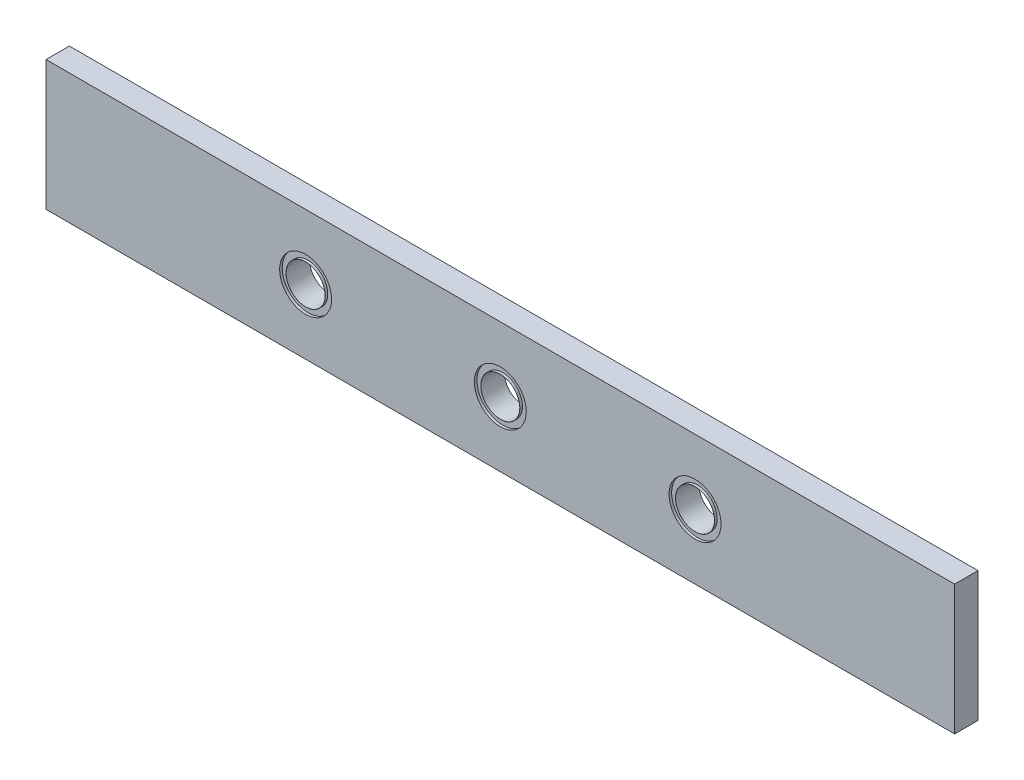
ISO-10303-21;
HEADER;
FILE_DESCRIPTION(('STEP AP214'),'2;1');
FILE_NAME('part.step','',(''),(''),'','','');
FILE_SCHEMA(('AUTOMOTIVE_DESIGN { 1 0 10303 214 1 1 1 1 }'));
ENDSEC;
DATA;
#1=APPLICATION_CONTEXT('core data for automotive mechanical design processes');
#2=APPLICATION_PROTOCOL_DEFINITION('international standard','automotive_design',2000,#1);
#3=PRODUCT_CONTEXT('',#1,'mechanical');
#4=PRODUCT('Part','Part','',(#3));
#5=PRODUCT_RELATED_PRODUCT_CATEGORY('part','',(#4));
#6=PRODUCT_DEFINITION_FORMATION('','',#4);
#7=PRODUCT_DEFINITION_CONTEXT('part definition',#1,'design');
#8=PRODUCT_DEFINITION('design','',#6,#7);
#9=PRODUCT_DEFINITION_SHAPE('','',#8);
#10=(LENGTH_UNIT() NAMED_UNIT(*) SI_UNIT(.MILLI.,.METRE.));
#11=(NAMED_UNIT(*) PLANE_ANGLE_UNIT() SI_UNIT($,.RADIAN.));
#12=(NAMED_UNIT(*) SI_UNIT($,.STERADIAN.) SOLID_ANGLE_UNIT());
#13=UNCERTAINTY_MEASURE_WITH_UNIT(LENGTH_MEASURE(1.E-05),#10,'distance_accuracy_value','');
#14=(GEOMETRIC_REPRESENTATION_CONTEXT(3) GLOBAL_UNCERTAINTY_ASSIGNED_CONTEXT((#13)) GLOBAL_UNIT_ASSIGNED_CONTEXT((#10,
#11,#12)) REPRESENTATION_CONTEXT('',''));
#15=CARTESIAN_POINT('',(0.,0.,0.));
#16=DIRECTION('',(0.,0.,1.));
#17=DIRECTION('',(1.,0.,0.));
#18=AXIS2_PLACEMENT_3D('',#15,#16,#17);
#19=CARTESIAN_POINT('',(0.,0.,0.));
#20=DIRECTION('',(0.,0.,1.));
#21=DIRECTION('',(1.,0.,0.));
#22=AXIS2_PLACEMENT_3D('',#19,#20,#21);
#23=PLANE('',#22);
#24=DIRECTION('',(0.,1.,0.));
#25=VECTOR('',#24,1.);
#26=CARTESIAN_POINT('',(350.,50.,0.));
#27=LINE('',#26,#25);
#28=CARTESIAN_POINT('',(350.,-50.,0.));
#29=VERTEX_POINT('',#28);
#30=CARTESIAN_POINT('',(350.,50.,0.));
#31=VERTEX_POINT('',#30);
#32=EDGE_CURVE('E96',#29,#31,#27,.T.);
#33=ORIENTED_EDGE('',*,*,#32,.F.);
#34=DIRECTION('',(1.,0.,0.));
#35=VECTOR('',#34,1.);
#36=CARTESIAN_POINT('',(-350.,-50.,0.));
#37=LINE('',#36,#35);
#38=CARTESIAN_POINT('',(-350.,-50.,0.));
#39=VERTEX_POINT('',#38);
#40=EDGE_CURVE('E72',#39,#29,#37,.T.);
#41=ORIENTED_EDGE('',*,*,#40,.F.);
#42=DIRECTION('',(0.,-1.,0.));
#43=VECTOR('',#42,1.);
#44=CARTESIAN_POINT('',(-350.,50.,0.));
#45=LINE('',#44,#43);
#46=CARTESIAN_POINT('',(-350.,50.,0.));
#47=VERTEX_POINT('',#46);
#48=EDGE_CURVE('E66',#47,#39,#45,.T.);
#49=ORIENTED_EDGE('',*,*,#48,.F.);
#50=DIRECTION('',(-1.,0.,0.));
#51=VECTOR('',#50,1.);
#52=CARTESIAN_POINT('',(-350.,50.,0.));
#53=LINE('',#52,#51);
#54=EDGE_CURVE('E88',#31,#47,#53,.T.);
#55=ORIENTED_EDGE('',*,*,#54,.F.);
#56=EDGE_LOOP('',(#33,#41,#49,#55));
#57=FACE_BOUND('',#56,.T.);
#58=CARTESIAN_POINT('',(0.,0.,0.));
#59=DIRECTION('',(0.,0.,1.));
#60=DIRECTION('',(1.,0.,0.));
#61=AXIS2_PLACEMENT_3D('',#58,#59,#60);
#62=CIRCLE('',#61,20.);
#63=CARTESIAN_POINT('',(20.,0.,0.));
#64=VERTEX_POINT('',#63);
#65=EDGE_CURVE('E164',#64,#64,#62,.T.);
#66=ORIENTED_EDGE('',*,*,#65,.T.);
#67=EDGE_LOOP('',(#66));
#68=FACE_BOUND('',#67,.T.);
#69=CARTESIAN_POINT('',(-150.,0.,0.));
#70=DIRECTION('',(0.,0.,1.));
#71=DIRECTION('',(1.,0.,0.));
#72=AXIS2_PLACEMENT_3D('',#69,#70,#71);
#73=CIRCLE('',#72,20.);
#74=CARTESIAN_POINT('',(-130.,0.,0.));
#75=VERTEX_POINT('',#74);
#76=EDGE_CURVE('E176',#75,#75,#73,.T.);
#77=ORIENTED_EDGE('',*,*,#76,.T.);
#78=EDGE_LOOP('',(#77));
#79=FACE_BOUND('',#78,.T.);
#80=CARTESIAN_POINT('',(150.,0.,0.));
#81=DIRECTION('',(0.,0.,1.));
#82=DIRECTION('',(1.,0.,0.));
#83=AXIS2_PLACEMENT_3D('',#80,#81,#82);
#84=CIRCLE('',#83,20.);
#85=CARTESIAN_POINT('',(170.,0.,0.));
#86=VERTEX_POINT('',#85);
#87=EDGE_CURVE('E188',#86,#86,#84,.T.);
#88=ORIENTED_EDGE('',*,*,#87,.T.);
#89=EDGE_LOOP('',(#88));
#90=FACE_BOUND('',#89,.T.);
#91=ADVANCED_FACE('F32',(#57,#68,#79,#90),#23,.F.);
#92=CARTESIAN_POINT('',(150.,0.,0.));
#93=DIRECTION('',(0.,0.,1.));
#94=DIRECTION('',(1.,0.,0.));
#95=AXIS2_PLACEMENT_3D('',#92,#93,#94);
#96=CIRCLE('',#95,15.05);
#97=CARTESIAN_POINT('',(165.05,0.,0.));
#98=VERTEX_POINT('',#97);
#99=EDGE_CURVE('E194',#98,#98,#96,.T.);
#100=ORIENTED_EDGE('',*,*,#99,.F.);
#101=EDGE_LOOP('',(#100));
#102=FACE_BOUND('',#101,.T.);
#103=CARTESIAN_POINT('',(150.,0.,0.));
#104=DIRECTION('',(0.,0.,1.));
#105=DIRECTION('',(1.,0.,0.));
#106=AXIS2_PLACEMENT_3D('',#103,#104,#105);
#107=CIRCLE('',#106,15.);
#108=CARTESIAN_POINT('',(165.,0.,0.));
#109=VERTEX_POINT('',#108);
#110=EDGE_CURVE('E99',#109,#109,#107,.T.);
#111=ORIENTED_EDGE('',*,*,#110,.T.);
#112=EDGE_LOOP('',(#111));
#113=FACE_BOUND('',#112,.T.);
#114=ADVANCED_FACE('F209',(#102,#113),#23,.F.);
#115=CARTESIAN_POINT('',(-150.,0.,0.));
#116=DIRECTION('',(0.,0.,1.));
#117=DIRECTION('',(1.,0.,0.));
#118=AXIS2_PLACEMENT_3D('',#115,#116,#117);
#119=CIRCLE('',#118,15.05);
#120=CARTESIAN_POINT('',(-134.95,0.,0.));
#121=VERTEX_POINT('',#120);
#122=EDGE_CURVE('E182',#121,#121,#119,.T.);
#123=ORIENTED_EDGE('',*,*,#122,.F.);
#124=EDGE_LOOP('',(#123));
#125=FACE_BOUND('',#124,.T.);
#126=CARTESIAN_POINT('',(-150.,0.,0.));
#127=DIRECTION('',(0.,0.,1.));
#128=DIRECTION('',(-1.,0.,0.));
#129=AXIS2_PLACEMENT_3D('',#126,#127,#128);
#130=CIRCLE('',#129,15.);
#131=CARTESIAN_POINT('',(-165.,0.,0.));
#132=VERTEX_POINT('',#131);
#133=EDGE_CURVE('E113',#132,#132,#130,.T.);
#134=ORIENTED_EDGE('',*,*,#133,.T.);
#135=EDGE_LOOP('',(#134));
#136=FACE_BOUND('',#135,.T.);
#137=ADVANCED_FACE('F212',(#125,#136),#23,.F.);
#138=CARTESIAN_POINT('',(0.,0.,18.));
#139=DIRECTION('',(0.,0.,1.));
#140=DIRECTION('',(1.,0.,0.));
#141=AXIS2_PLACEMENT_3D('',#138,#139,#140);
#142=PLANE('',#141);
#143=CARTESIAN_POINT('',(150.,0.,18.));
#144=DIRECTION('',(0.,0.,1.));
#145=DIRECTION('',(1.,0.,0.));
#146=AXIS2_PLACEMENT_3D('',#143,#144,#145);
#147=CIRCLE('',#146,15.);
#148=CARTESIAN_POINT('',(165.,0.,18.));
#149=VERTEX_POINT('',#148);
#150=EDGE_CURVE('E110',#149,#149,#147,.T.);
#151=ORIENTED_EDGE('',*,*,#150,.F.);
#152=EDGE_LOOP('',(#151));
#153=FACE_BOUND('',#152,.T.);
#154=CARTESIAN_POINT('',(150.,0.,18.));
#155=DIRECTION('',(0.,0.,1.));
#156=DIRECTION('',(1.,0.,0.));
#157=AXIS2_PLACEMENT_3D('',#154,#155,#156);
#158=CIRCLE('',#157,15.05);
#159=CARTESIAN_POINT('',(165.05,0.,18.));
#160=VERTEX_POINT('',#159);
#161=EDGE_CURVE('E158',#160,#160,#158,.T.);
#162=ORIENTED_EDGE('',*,*,#161,.T.);
#163=EDGE_LOOP('',(#162));
#164=FACE_BOUND('',#163,.T.);
#165=ADVANCED_FACE('F224',(#153,#164),#142,.T.);
#166=CARTESIAN_POINT('',(-150.,0.,18.));
#167=DIRECTION('',(0.,0.,1.));
#168=DIRECTION('',(-1.,0.,0.));
#169=AXIS2_PLACEMENT_3D('',#166,#167,#168);
#170=CIRCLE('',#169,15.);
#171=CARTESIAN_POINT('',(-165.,0.,18.));
#172=VERTEX_POINT('',#171);
#173=EDGE_CURVE('E116',#172,#172,#170,.T.);
#174=ORIENTED_EDGE('',*,*,#173,.F.);
#175=EDGE_LOOP('',(#174));
#176=FACE_BOUND('',#175,.T.);
#177=CARTESIAN_POINT('',(-150.,0.,18.));
#178=DIRECTION('',(0.,0.,1.));
#179=DIRECTION('',(1.,0.,0.));
#180=AXIS2_PLACEMENT_3D('',#177,#178,#179);
#181=CIRCLE('',#180,15.05);
#182=CARTESIAN_POINT('',(-134.95,0.,18.));
#183=VERTEX_POINT('',#182);
#184=EDGE_CURVE('E146',#183,#183,#181,.T.);
#185=ORIENTED_EDGE('',*,*,#184,.T.);
#186=EDGE_LOOP('',(#185));
#187=FACE_BOUND('',#186,.T.);
#188=ADVANCED_FACE('F227',(#176,#187),#142,.T.);
#189=CARTESIAN_POINT('',(0.,0.,18.));
#190=DIRECTION('',(0.,0.,1.));
#191=DIRECTION('',(1.,0.,0.));
#192=AXIS2_PLACEMENT_3D('',#189,#190,#191);
#193=CIRCLE('',#192,15.);
#194=CARTESIAN_POINT('',(15.,0.,18.));
#195=VERTEX_POINT('',#194);
#196=EDGE_CURVE('E122',#195,#195,#193,.T.);
#197=ORIENTED_EDGE('',*,*,#196,.F.);
#198=EDGE_LOOP('',(#197));
#199=FACE_BOUND('',#198,.T.);
#200=CARTESIAN_POINT('',(0.,0.,18.));
#201=DIRECTION('',(0.,0.,1.));
#202=DIRECTION('',(1.,0.,0.));
#203=AXIS2_PLACEMENT_3D('',#200,#201,#202);
#204=CIRCLE('',#203,15.05);
#205=CARTESIAN_POINT('',(15.05,0.,18.));
#206=VERTEX_POINT('',#205);
#207=EDGE_CURVE('E134',#206,#206,#204,.T.);
#208=ORIENTED_EDGE('',*,*,#207,.T.);
#209=EDGE_LOOP('',(#208));
#210=FACE_BOUND('',#209,.T.);
#211=ADVANCED_FACE('F258',(#199,#210),#142,.T.);
#212=CARTESIAN_POINT('',(350.,50.,18.));
#213=DIRECTION('',(-1.,0.,0.));
#214=DIRECTION('',(0.,-1.,0.));
#215=AXIS2_PLACEMENT_3D('',#212,#213,#214);
#216=PLANE('',#215);
#217=ORIENTED_EDGE('',*,*,#32,.T.);
#218=DIRECTION('',(0.,0.,-1.));
#219=VECTOR('',#218,1.);
#220=CARTESIAN_POINT('',(350.,50.,18.));
#221=LINE('',#220,#219);
#222=CARTESIAN_POINT('',(350.,50.,18.));
#223=VERTEX_POINT('',#222);
#224=EDGE_CURVE('E11',#223,#31,#221,.T.);
#225=ORIENTED_EDGE('',*,*,#224,.F.);
#226=DIRECTION('',(0.,1.,0.));
#227=VECTOR('',#226,1.);
#228=CARTESIAN_POINT('',(350.,50.,18.));
#229=LINE('',#228,#227);
#230=CARTESIAN_POINT('',(350.,-50.,18.));
#231=VERTEX_POINT('',#230);
#232=EDGE_CURVE('E84',#231,#223,#229,.T.);
#233=ORIENTED_EDGE('',*,*,#232,.F.);
#234=DIRECTION('',(0.,0.,-1.));
#235=VECTOR('',#234,1.);
#236=CARTESIAN_POINT('',(350.,-50.,18.));
#237=LINE('',#236,#235);
#238=EDGE_CURVE('E92',#231,#29,#237,.T.);
#239=ORIENTED_EDGE('',*,*,#238,.T.);
#240=EDGE_LOOP('',(#217,#225,#233,#239));
#241=FACE_BOUND('',#240,.T.);
#242=ADVANCED_FACE('F34',(#241),#216,.F.);
#243=CARTESIAN_POINT('',(-350.,50.,18.));
#244=DIRECTION('',(0.,-1.,0.));
#245=DIRECTION('',(0.,0.,-1.));
#246=AXIS2_PLACEMENT_3D('',#243,#244,#245);
#247=PLANE('',#246);
#248=ORIENTED_EDGE('',*,*,#54,.T.);
#249=DIRECTION('',(0.,0.,-1.));
#250=VECTOR('',#249,1.);
#251=CARTESIAN_POINT('',(-350.,50.,18.));
#252=LINE('',#251,#250);
#253=CARTESIAN_POINT('',(-350.,50.,18.));
#254=VERTEX_POINT('',#253);
#255=EDGE_CURVE('E41',#254,#47,#252,.T.);
#256=ORIENTED_EDGE('',*,*,#255,.F.);
#257=DIRECTION('',(-1.,0.,0.));
#258=VECTOR('',#257,1.);
#259=CARTESIAN_POINT('',(-350.,50.,18.));
#260=LINE('',#259,#258);
#261=EDGE_CURVE('E79',#223,#254,#260,.T.);
#262=ORIENTED_EDGE('',*,*,#261,.F.);
#263=ORIENTED_EDGE('',*,*,#224,.T.);
#264=EDGE_LOOP('',(#248,#256,#262,#263));
#265=FACE_BOUND('',#264,.T.);
#266=ADVANCED_FACE('F87',(#265),#247,.F.);
#267=CARTESIAN_POINT('',(-350.,50.,18.));
#268=DIRECTION('',(1.,0.,0.));
#269=DIRECTION('',(0.,1.,0.));
#270=AXIS2_PLACEMENT_3D('',#267,#268,#269);
#271=PLANE('',#270);
#272=ORIENTED_EDGE('',*,*,#48,.T.);
#273=DIRECTION('',(0.,0.,-1.));
#274=VECTOR('',#273,1.);
#275=CARTESIAN_POINT('',(-350.,-50.,18.));
#276=LINE('',#275,#274);
#277=CARTESIAN_POINT('',(-350.,-50.,18.));
#278=VERTEX_POINT('',#277);
#279=EDGE_CURVE('E89',#278,#39,#276,.T.);
#280=ORIENTED_EDGE('',*,*,#279,.F.);
#281=DIRECTION('',(0.,-1.,0.));
#282=VECTOR('',#281,1.);
#283=CARTESIAN_POINT('',(-350.,50.,18.));
#284=LINE('',#283,#282);
#285=EDGE_CURVE('E82',#254,#278,#284,.T.);
#286=ORIENTED_EDGE('',*,*,#285,.F.);
#287=ORIENTED_EDGE('',*,*,#255,.T.);
#288=EDGE_LOOP('',(#272,#280,#286,#287));
#289=FACE_BOUND('',#288,.T.);
#290=ADVANCED_FACE('F90',(#289),#271,.F.);
#291=CARTESIAN_POINT('',(-350.,-50.,18.));
#292=DIRECTION('',(0.,1.,0.));
#293=DIRECTION('',(0.,0.,1.));
#294=AXIS2_PLACEMENT_3D('',#291,#292,#293);
#295=PLANE('',#294);
#296=ORIENTED_EDGE('',*,*,#40,.T.);
#297=ORIENTED_EDGE('',*,*,#238,.F.);
#298=DIRECTION('',(1.,0.,0.));
#299=VECTOR('',#298,1.);
#300=CARTESIAN_POINT('',(-350.,-50.,18.));
#301=LINE('',#300,#299);
#302=EDGE_CURVE('E49',#278,#231,#301,.T.);
#303=ORIENTED_EDGE('',*,*,#302,.F.);
#304=ORIENTED_EDGE('',*,*,#279,.T.);
#305=EDGE_LOOP('',(#296,#297,#303,#304));
#306=FACE_BOUND('',#305,.T.);
#307=ADVANCED_FACE('F104',(#306),#295,.F.);
#308=CARTESIAN_POINT('',(150.,0.,18.));
#309=DIRECTION('',(0.,0.,1.));
#310=DIRECTION('',(1.,0.,0.));
#311=AXIS2_PLACEMENT_3D('',#308,#309,#310);
#312=CIRCLE('',#311,20.);
#313=CARTESIAN_POINT('',(170.,0.,18.));
#314=VERTEX_POINT('',#313);
#315=EDGE_CURVE('E152',#314,#314,#312,.T.);
#316=ORIENTED_EDGE('',*,*,#315,.F.);
#317=EDGE_LOOP('',(#316));
#318=FACE_BOUND('',#317,.T.);
#319=CARTESIAN_POINT('',(-150.,0.,18.));
#320=DIRECTION('',(0.,0.,1.));
#321=DIRECTION('',(1.,0.,0.));
#322=AXIS2_PLACEMENT_3D('',#319,#320,#321);
#323=CIRCLE('',#322,20.);
#324=CARTESIAN_POINT('',(-130.,0.,18.));
#325=VERTEX_POINT('',#324);
#326=EDGE_CURVE('E140',#325,#325,#323,.T.);
#327=ORIENTED_EDGE('',*,*,#326,.F.);
#328=EDGE_LOOP('',(#327));
#329=FACE_BOUND('',#328,.T.);
#330=CARTESIAN_POINT('',(0.,0.,18.));
#331=DIRECTION('',(0.,0.,1.));
#332=DIRECTION('',(1.,0.,0.));
#333=AXIS2_PLACEMENT_3D('',#330,#331,#332);
#334=CIRCLE('',#333,20.);
#335=CARTESIAN_POINT('',(20.,0.,18.));
#336=VERTEX_POINT('',#335);
#337=EDGE_CURVE('E128',#336,#336,#334,.T.);
#338=ORIENTED_EDGE('',*,*,#337,.F.);
#339=EDGE_LOOP('',(#338));
#340=FACE_BOUND('',#339,.T.);
#341=ORIENTED_EDGE('',*,*,#232,.T.);
#342=ORIENTED_EDGE('',*,*,#261,.T.);
#343=ORIENTED_EDGE('',*,*,#285,.T.);
#344=ORIENTED_EDGE('',*,*,#302,.T.);
#345=EDGE_LOOP('',(#341,#342,#343,#344));
#346=FACE_BOUND('',#345,.T.);
#347=ADVANCED_FACE('F80',(#318,#329,#340,#346),#142,.T.);
#348=CARTESIAN_POINT('',(0.,0.,0.));
#349=DIRECTION('',(0.,0.,1.));
#350=DIRECTION('',(1.,0.,0.));
#351=AXIS2_PLACEMENT_3D('',#348,#349,#350);
#352=CIRCLE('',#351,15.05);
#353=CARTESIAN_POINT('',(15.05,0.,0.));
#354=VERTEX_POINT('',#353);
#355=EDGE_CURVE('E170',#354,#354,#352,.T.);
#356=ORIENTED_EDGE('',*,*,#355,.F.);
#357=EDGE_LOOP('',(#356));
#358=FACE_BOUND('',#357,.T.);
#359=CARTESIAN_POINT('',(0.,0.,0.));
#360=DIRECTION('',(0.,0.,1.));
#361=DIRECTION('',(1.,0.,0.));
#362=AXIS2_PLACEMENT_3D('',#359,#360,#361);
#363=CIRCLE('',#362,15.);
#364=CARTESIAN_POINT('',(15.,0.,0.));
#365=VERTEX_POINT('',#364);
#366=EDGE_CURVE('E119',#365,#365,#363,.T.);
#367=ORIENTED_EDGE('',*,*,#366,.T.);
#368=EDGE_LOOP('',(#367));
#369=FACE_BOUND('',#368,.T.);
#370=ADVANCED_FACE('F220',(#358,#369),#23,.F.);
#371=CARTESIAN_POINT('',(150.,0.,0.));
#372=DIRECTION('',(0.,0.,1.));
#373=DIRECTION('',(1.,0.,0.));
#374=AXIS2_PLACEMENT_3D('',#371,#372,#373);
#375=CYLINDRICAL_SURFACE('',#374,15.);
#376=ORIENTED_EDGE('',*,*,#110,.F.);
#377=EDGE_LOOP('',(#376));
#378=FACE_BOUND('',#377,.T.);
#379=ORIENTED_EDGE('',*,*,#150,.T.);
#380=EDGE_LOOP('',(#379));
#381=FACE_BOUND('',#380,.T.);
#382=ADVANCED_FACE('F216',(#378,#381),#375,.F.);
#383=CARTESIAN_POINT('',(-150.,0.,0.));
#384=DIRECTION('',(0.,0.,1.));
#385=DIRECTION('',(1.,0.,0.));
#386=AXIS2_PLACEMENT_3D('',#383,#384,#385);
#387=CYLINDRICAL_SURFACE('',#386,15.);
#388=ORIENTED_EDGE('',*,*,#133,.F.);
#389=EDGE_LOOP('',(#388));
#390=FACE_BOUND('',#389,.T.);
#391=ORIENTED_EDGE('',*,*,#173,.T.);
#392=EDGE_LOOP('',(#391));
#393=FACE_BOUND('',#392,.T.);
#394=ADVANCED_FACE('F219',(#390,#393),#387,.F.);
#395=CARTESIAN_POINT('',(0.,0.,0.));
#396=DIRECTION('',(0.,0.,1.));
#397=DIRECTION('',(1.,0.,0.));
#398=AXIS2_PLACEMENT_3D('',#395,#396,#397);
#399=CYLINDRICAL_SURFACE('',#398,15.);
#400=ORIENTED_EDGE('',*,*,#366,.F.);
#401=EDGE_LOOP('',(#400));
#402=FACE_BOUND('',#401,.T.);
#403=ORIENTED_EDGE('',*,*,#196,.T.);
#404=EDGE_LOOP('',(#403));
#405=FACE_BOUND('',#404,.T.);
#406=ADVANCED_FACE('F271',(#402,#405),#399,.F.);
#407=CARTESIAN_POINT('',(0.,0.,16.));
#408=DIRECTION('',(0.,0.,1.));
#409=DIRECTION('',(1.,0.,0.));
#410=AXIS2_PLACEMENT_3D('',#407,#408,#409);
#411=CYLINDRICAL_SURFACE('',#410,20.);
#412=CARTESIAN_POINT('',(0.,0.,16.));
#413=DIRECTION('',(0.,0.,1.));
#414=DIRECTION('',(1.,0.,0.));
#415=AXIS2_PLACEMENT_3D('',#412,#413,#414);
#416=CIRCLE('',#415,20.);
#417=CARTESIAN_POINT('',(20.,0.,16.));
#418=VERTEX_POINT('',#417);
#419=EDGE_CURVE('E125',#418,#418,#416,.T.);
#420=ORIENTED_EDGE('',*,*,#419,.F.);
#421=EDGE_LOOP('',(#420));
#422=FACE_BOUND('',#421,.T.);
#423=ORIENTED_EDGE('',*,*,#337,.T.);
#424=EDGE_LOOP('',(#423));
#425=FACE_BOUND('',#424,.T.);
#426=ADVANCED_FACE('F304',(#422,#425),#411,.F.);
#427=CARTESIAN_POINT('',(0.,0.,16.));
#428=DIRECTION('',(0.,0.,1.));
#429=DIRECTION('',(1.,0.,0.));
#430=AXIS2_PLACEMENT_3D('',#427,#428,#429);
#431=PLANE('',#430);
#432=CARTESIAN_POINT('',(0.,0.,16.));
#433=DIRECTION('',(0.,0.,1.));
#434=DIRECTION('',(1.,0.,0.));
#435=AXIS2_PLACEMENT_3D('',#432,#433,#434);
#436=CIRCLE('',#435,15.05);
#437=CARTESIAN_POINT('',(15.05,0.,16.));
#438=VERTEX_POINT('',#437);
#439=EDGE_CURVE('E131',#438,#438,#436,.T.);
#440=ORIENTED_EDGE('',*,*,#439,.F.);
#441=EDGE_LOOP('',(#440));
#442=FACE_BOUND('',#441,.T.);
#443=ORIENTED_EDGE('',*,*,#419,.T.);
#444=EDGE_LOOP('',(#443));
#445=FACE_BOUND('',#444,.T.);
#446=ADVANCED_FACE('F300',(#442,#445),#431,.T.);
#447=CARTESIAN_POINT('',(0.,0.,16.));
#448=DIRECTION('',(0.,0.,1.));
#449=DIRECTION('',(1.,0.,0.));
#450=AXIS2_PLACEMENT_3D('',#447,#448,#449);
#451=CYLINDRICAL_SURFACE('',#450,15.05);
#452=ORIENTED_EDGE('',*,*,#439,.T.);
#453=EDGE_LOOP('',(#452));
#454=FACE_BOUND('',#453,.T.);
#455=ORIENTED_EDGE('',*,*,#207,.F.);
#456=EDGE_LOOP('',(#455));
#457=FACE_BOUND('',#456,.T.);
#458=ADVANCED_FACE('F296',(#454,#457),#451,.T.);
#459=CARTESIAN_POINT('',(-150.,0.,16.));
#460=DIRECTION('',(0.,0.,1.));
#461=DIRECTION('',(1.,0.,0.));
#462=AXIS2_PLACEMENT_3D('',#459,#460,#461);
#463=CYLINDRICAL_SURFACE('',#462,20.);
#464=CARTESIAN_POINT('',(-150.,0.,16.));
#465=DIRECTION('',(0.,0.,1.));
#466=DIRECTION('',(1.,0.,0.));
#467=AXIS2_PLACEMENT_3D('',#464,#465,#466);
#468=CIRCLE('',#467,20.);
#469=CARTESIAN_POINT('',(-130.,0.,16.));
#470=VERTEX_POINT('',#469);
#471=EDGE_CURVE('E137',#470,#470,#468,.T.);
#472=ORIENTED_EDGE('',*,*,#471,.F.);
#473=EDGE_LOOP('',(#472));
#474=FACE_BOUND('',#473,.T.);
#475=ORIENTED_EDGE('',*,*,#326,.T.);
#476=EDGE_LOOP('',(#475));
#477=FACE_BOUND('',#476,.T.);
#478=ADVANCED_FACE('F290',(#474,#477),#463,.F.);
#479=CARTESIAN_POINT('',(-150.,0.,16.));
#480=DIRECTION('',(0.,0.,1.));
#481=DIRECTION('',(1.,0.,0.));
#482=AXIS2_PLACEMENT_3D('',#479,#480,#481);
#483=PLANE('',#482);
#484=CARTESIAN_POINT('',(-150.,0.,16.));
#485=DIRECTION('',(0.,0.,1.));
#486=DIRECTION('',(1.,0.,0.));
#487=AXIS2_PLACEMENT_3D('',#484,#485,#486);
#488=CIRCLE('',#487,15.05);
#489=CARTESIAN_POINT('',(-134.95,0.,16.));
#490=VERTEX_POINT('',#489);
#491=EDGE_CURVE('E143',#490,#490,#488,.T.);
#492=ORIENTED_EDGE('',*,*,#491,.F.);
#493=EDGE_LOOP('',(#492));
#494=FACE_BOUND('',#493,.T.);
#495=ORIENTED_EDGE('',*,*,#471,.T.);
#496=EDGE_LOOP('',(#495));
#497=FACE_BOUND('',#496,.T.);
#498=ADVANCED_FACE('F281',(#494,#497),#483,.T.);
#499=CARTESIAN_POINT('',(-150.,0.,16.));
#500=DIRECTION('',(0.,0.,1.));
#501=DIRECTION('',(1.,0.,0.));
#502=AXIS2_PLACEMENT_3D('',#499,#500,#501);
#503=CYLINDRICAL_SURFACE('',#502,15.05);
#504=ORIENTED_EDGE('',*,*,#491,.T.);
#505=EDGE_LOOP('',(#504));
#506=FACE_BOUND('',#505,.T.);
#507=ORIENTED_EDGE('',*,*,#184,.F.);
#508=EDGE_LOOP('',(#507));
#509=FACE_BOUND('',#508,.T.);
#510=ADVANCED_FACE('F279',(#506,#509),#503,.T.);
#511=CARTESIAN_POINT('',(150.,0.,16.));
#512=DIRECTION('',(0.,0.,1.));
#513=DIRECTION('',(1.,0.,0.));
#514=AXIS2_PLACEMENT_3D('',#511,#512,#513);
#515=CYLINDRICAL_SURFACE('',#514,20.);
#516=CARTESIAN_POINT('',(150.,0.,16.));
#517=DIRECTION('',(0.,0.,1.));
#518=DIRECTION('',(1.,0.,0.));
#519=AXIS2_PLACEMENT_3D('',#516,#517,#518);
#520=CIRCLE('',#519,20.);
#521=CARTESIAN_POINT('',(170.,0.,16.));
#522=VERTEX_POINT('',#521);
#523=EDGE_CURVE('E149',#522,#522,#520,.T.);
#524=ORIENTED_EDGE('',*,*,#523,.F.);
#525=EDGE_LOOP('',(#524));
#526=FACE_BOUND('',#525,.T.);
#527=ORIENTED_EDGE('',*,*,#315,.T.);
#528=EDGE_LOOP('',(#527));
#529=FACE_BOUND('',#528,.T.);
#530=ADVANCED_FACE('F244',(#526,#529),#515,.F.);
#531=CARTESIAN_POINT('',(150.,0.,16.));
#532=DIRECTION('',(0.,0.,1.));
#533=DIRECTION('',(1.,0.,0.));
#534=AXIS2_PLACEMENT_3D('',#531,#532,#533);
#535=PLANE('',#534);
#536=CARTESIAN_POINT('',(150.,0.,16.));
#537=DIRECTION('',(0.,0.,1.));
#538=DIRECTION('',(1.,0.,0.));
#539=AXIS2_PLACEMENT_3D('',#536,#537,#538);
#540=CIRCLE('',#539,15.05);
#541=CARTESIAN_POINT('',(165.05,0.,16.));
#542=VERTEX_POINT('',#541);
#543=EDGE_CURVE('E155',#542,#542,#540,.T.);
#544=ORIENTED_EDGE('',*,*,#543,.F.);
#545=EDGE_LOOP('',(#544));
#546=FACE_BOUND('',#545,.T.);
#547=ORIENTED_EDGE('',*,*,#523,.T.);
#548=EDGE_LOOP('',(#547));
#549=FACE_BOUND('',#548,.T.);
#550=ADVANCED_FACE('F234',(#546,#549),#535,.T.);
#551=CARTESIAN_POINT('',(150.,0.,16.));
#552=DIRECTION('',(0.,0.,1.));
#553=DIRECTION('',(1.,0.,0.));
#554=AXIS2_PLACEMENT_3D('',#551,#552,#553);
#555=CYLINDRICAL_SURFACE('',#554,15.05);
#556=ORIENTED_EDGE('',*,*,#543,.T.);
#557=EDGE_LOOP('',(#556));
#558=FACE_BOUND('',#557,.T.);
#559=ORIENTED_EDGE('',*,*,#161,.F.);
#560=EDGE_LOOP('',(#559));
#561=FACE_BOUND('',#560,.T.);
#562=ADVANCED_FACE('F231',(#558,#561),#555,.T.);
#563=CARTESIAN_POINT('',(0.,0.,2.));
#564=DIRECTION('',(0.,0.,-1.));
#565=DIRECTION('',(1.,0.,0.));
#566=AXIS2_PLACEMENT_3D('',#563,#564,#565);
#567=PLANE('',#566);
#568=CARTESIAN_POINT('',(0.,0.,2.));
#569=DIRECTION('',(0.,0.,1.));
#570=DIRECTION('',(1.,0.,0.));
#571=AXIS2_PLACEMENT_3D('',#568,#569,#570);
#572=CIRCLE('',#571,20.);
#573=CARTESIAN_POINT('',(20.,0.,2.));
#574=VERTEX_POINT('',#573);
#575=EDGE_CURVE('E161',#574,#574,#572,.T.);
#576=ORIENTED_EDGE('',*,*,#575,.F.);
#577=EDGE_LOOP('',(#576));
#578=FACE_BOUND('',#577,.T.);
#579=CARTESIAN_POINT('',(0.,0.,2.));
#580=DIRECTION('',(0.,0.,1.));
#581=DIRECTION('',(1.,0.,0.));
#582=AXIS2_PLACEMENT_3D('',#579,#580,#581);
#583=CIRCLE('',#582,15.05);
#584=CARTESIAN_POINT('',(15.05,0.,2.));
#585=VERTEX_POINT('',#584);
#586=EDGE_CURVE('E167',#585,#585,#583,.T.);
#587=ORIENTED_EDGE('',*,*,#586,.T.);
#588=EDGE_LOOP('',(#587));
#589=FACE_BOUND('',#588,.T.);
#590=ADVANCED_FACE('F233',(#578,#589),#567,.T.);
#591=CARTESIAN_POINT('',(0.,0.,2.));
#592=DIRECTION('',(0.,0.,-1.));
#593=DIRECTION('',(-1.,0.,0.));
#594=AXIS2_PLACEMENT_3D('',#591,#592,#593);
#595=CYLINDRICAL_SURFACE('',#594,20.);
#596=ORIENTED_EDGE('',*,*,#575,.T.);
#597=EDGE_LOOP('',(#596));
#598=FACE_BOUND('',#597,.T.);
#599=ORIENTED_EDGE('',*,*,#65,.F.);
#600=EDGE_LOOP('',(#599));
#601=FACE_BOUND('',#600,.T.);
#602=ADVANCED_FACE('F241',(#598,#601),#595,.F.);
#603=CARTESIAN_POINT('',(0.,0.,2.));
#604=DIRECTION('',(0.,0.,-1.));
#605=DIRECTION('',(-1.,0.,0.));
#606=AXIS2_PLACEMENT_3D('',#603,#604,#605);
#607=CYLINDRICAL_SURFACE('',#606,15.05);
#608=ORIENTED_EDGE('',*,*,#586,.F.);
#609=EDGE_LOOP('',(#608));
#610=FACE_BOUND('',#609,.T.);
#611=ORIENTED_EDGE('',*,*,#355,.T.);
#612=EDGE_LOOP('',(#611));
#613=FACE_BOUND('',#612,.T.);
#614=ADVANCED_FACE('F429',(#610,#613),#607,.T.);
#615=CARTESIAN_POINT('',(-150.,0.,2.));
#616=DIRECTION('',(0.,0.,-1.));
#617=DIRECTION('',(1.,0.,0.));
#618=AXIS2_PLACEMENT_3D('',#615,#616,#617);
#619=PLANE('',#618);
#620=CARTESIAN_POINT('',(-150.,0.,2.));
#621=DIRECTION('',(0.,0.,1.));
#622=DIRECTION('',(1.,0.,0.));
#623=AXIS2_PLACEMENT_3D('',#620,#621,#622);
#624=CIRCLE('',#623,20.);
#625=CARTESIAN_POINT('',(-130.,0.,2.));
#626=VERTEX_POINT('',#625);
#627=EDGE_CURVE('E173',#626,#626,#624,.T.);
#628=ORIENTED_EDGE('',*,*,#627,.F.);
#629=EDGE_LOOP('',(#628));
#630=FACE_BOUND('',#629,.T.);
#631=CARTESIAN_POINT('',(-150.,0.,2.));
#632=DIRECTION('',(0.,0.,1.));
#633=DIRECTION('',(1.,0.,0.));
#634=AXIS2_PLACEMENT_3D('',#631,#632,#633);
#635=CIRCLE('',#634,15.05);
#636=CARTESIAN_POINT('',(-134.95,0.,2.));
#637=VERTEX_POINT('',#636);
#638=EDGE_CURVE('E179',#637,#637,#635,.T.);
#639=ORIENTED_EDGE('',*,*,#638,.T.);
#640=EDGE_LOOP('',(#639));
#641=FACE_BOUND('',#640,.T.);
#642=ADVANCED_FACE('F438',(#630,#641),#619,.T.);
#643=CARTESIAN_POINT('',(-150.,0.,2.));
#644=DIRECTION('',(0.,0.,-1.));
#645=DIRECTION('',(-1.,0.,0.));
#646=AXIS2_PLACEMENT_3D('',#643,#644,#645);
#647=CYLINDRICAL_SURFACE('',#646,20.);
#648=ORIENTED_EDGE('',*,*,#627,.T.);
#649=EDGE_LOOP('',(#648));
#650=FACE_BOUND('',#649,.T.);
#651=ORIENTED_EDGE('',*,*,#76,.F.);
#652=EDGE_LOOP('',(#651));
#653=FACE_BOUND('',#652,.T.);
#654=ADVANCED_FACE('F448',(#650,#653),#647,.F.);
#655=CARTESIAN_POINT('',(-150.,0.,2.));
#656=DIRECTION('',(0.,0.,-1.));
#657=DIRECTION('',(-1.,0.,0.));
#658=AXIS2_PLACEMENT_3D('',#655,#656,#657);
#659=CYLINDRICAL_SURFACE('',#658,15.05);
#660=ORIENTED_EDGE('',*,*,#638,.F.);
#661=EDGE_LOOP('',(#660));
#662=FACE_BOUND('',#661,.T.);
#663=ORIENTED_EDGE('',*,*,#122,.T.);
#664=EDGE_LOOP('',(#663));
#665=FACE_BOUND('',#664,.T.);
#666=ADVANCED_FACE('F458',(#662,#665),#659,.T.);
#667=CARTESIAN_POINT('',(150.,0.,2.));
#668=DIRECTION('',(0.,0.,-1.));
#669=DIRECTION('',(1.,0.,0.));
#670=AXIS2_PLACEMENT_3D('',#667,#668,#669);
#671=PLANE('',#670);
#672=CARTESIAN_POINT('',(150.,0.,2.));
#673=DIRECTION('',(0.,0.,1.));
#674=DIRECTION('',(1.,0.,0.));
#675=AXIS2_PLACEMENT_3D('',#672,#673,#674);
#676=CIRCLE('',#675,20.);
#677=CARTESIAN_POINT('',(170.,0.,2.));
#678=VERTEX_POINT('',#677);
#679=EDGE_CURVE('E185',#678,#678,#676,.T.);
#680=ORIENTED_EDGE('',*,*,#679,.F.);
#681=EDGE_LOOP('',(#680));
#682=FACE_BOUND('',#681,.T.);
#683=CARTESIAN_POINT('',(150.,0.,2.));
#684=DIRECTION('',(0.,0.,1.));
#685=DIRECTION('',(1.,0.,0.));
#686=AXIS2_PLACEMENT_3D('',#683,#684,#685);
#687=CIRCLE('',#686,15.05);
#688=CARTESIAN_POINT('',(165.05,0.,2.));
#689=VERTEX_POINT('',#688);
#690=EDGE_CURVE('E191',#689,#689,#687,.T.);
#691=ORIENTED_EDGE('',*,*,#690,.T.);
#692=EDGE_LOOP('',(#691));
#693=FACE_BOUND('',#692,.T.);
#694=ADVANCED_FACE('F200',(#682,#693),#671,.T.);
#695=CARTESIAN_POINT('',(150.,0.,2.));
#696=DIRECTION('',(0.,0.,-1.));
#697=DIRECTION('',(-1.,0.,0.));
#698=AXIS2_PLACEMENT_3D('',#695,#696,#697);
#699=CYLINDRICAL_SURFACE('',#698,20.);
#700=ORIENTED_EDGE('',*,*,#679,.T.);
#701=EDGE_LOOP('',(#700));
#702=FACE_BOUND('',#701,.T.);
#703=ORIENTED_EDGE('',*,*,#87,.F.);
#704=EDGE_LOOP('',(#703));
#705=FACE_BOUND('',#704,.T.);
#706=ADVANCED_FACE('F205',(#702,#705),#699,.F.);
#707=CARTESIAN_POINT('',(150.,0.,2.));
#708=DIRECTION('',(0.,0.,-1.));
#709=DIRECTION('',(-1.,0.,0.));
#710=AXIS2_PLACEMENT_3D('',#707,#708,#709);
#711=CYLINDRICAL_SURFACE('',#710,15.05);
#712=ORIENTED_EDGE('',*,*,#690,.F.);
#713=EDGE_LOOP('',(#712));
#714=FACE_BOUND('',#713,.T.);
#715=ORIENTED_EDGE('',*,*,#99,.T.);
#716=EDGE_LOOP('',(#715));
#717=FACE_BOUND('',#716,.T.);
#718=ADVANCED_FACE('F202',(#714,#717),#711,.T.);
#719=CLOSED_SHELL('',(#91,#114,#137,#165,#188,#211,#242,#266,#290,#307,#347,#370,#382,#394,#406,
#426,#446,#458,#478,#498,#510,#530,#550,#562,#590,#602,#614,#642,#654,#666,#694,#706,#718));
#720=MANIFOLD_SOLID_BREP('B2',#719);
#721=ADVANCED_BREP_SHAPE_REPRESENTATION('',(#18,#720),#14);
#722=SHAPE_DEFINITION_REPRESENTATION(#9,#721);
ENDSEC;
END-ISO-10303-21;
